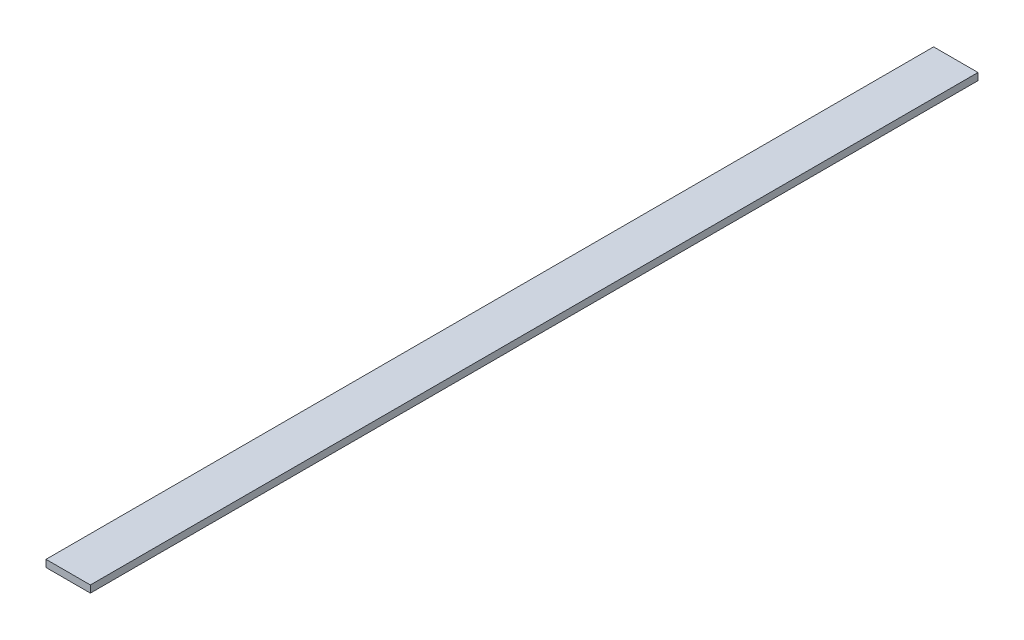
ISO-10303-21;
HEADER;
FILE_DESCRIPTION(('STEP AP214'),'2;1');
FILE_NAME('part.step','',(''),(''),'','','');
FILE_SCHEMA(('AUTOMOTIVE_DESIGN { 1 0 10303 214 1 1 1 1 }'));
ENDSEC;
DATA;
#1=APPLICATION_CONTEXT('core data for automotive mechanical design processes');
#2=APPLICATION_PROTOCOL_DEFINITION('international standard','automotive_design',2000,#1);
#3=PRODUCT_CONTEXT('',#1,'mechanical');
#4=PRODUCT('Part','Part','',(#3));
#5=PRODUCT_RELATED_PRODUCT_CATEGORY('part','',(#4));
#6=PRODUCT_DEFINITION_FORMATION('','',#4);
#7=PRODUCT_DEFINITION_CONTEXT('part definition',#1,'design');
#8=PRODUCT_DEFINITION('design','',#6,#7);
#9=PRODUCT_DEFINITION_SHAPE('','',#8);
#10=(LENGTH_UNIT() NAMED_UNIT(*) SI_UNIT(.MILLI.,.METRE.));
#11=(NAMED_UNIT(*) PLANE_ANGLE_UNIT() SI_UNIT($,.RADIAN.));
#12=(NAMED_UNIT(*) SI_UNIT($,.STERADIAN.) SOLID_ANGLE_UNIT());
#13=UNCERTAINTY_MEASURE_WITH_UNIT(LENGTH_MEASURE(1.E-05),#10,'distance_accuracy_value','');
#14=(GEOMETRIC_REPRESENTATION_CONTEXT(3) GLOBAL_UNCERTAINTY_ASSIGNED_CONTEXT((#13)) GLOBAL_UNIT_ASSIGNED_CONTEXT((#10,
#11,#12)) REPRESENTATION_CONTEXT('',''));
#15=CARTESIAN_POINT('',(0.,0.,0.));
#16=DIRECTION('',(0.,0.,1.));
#17=DIRECTION('',(1.,0.,0.));
#18=AXIS2_PLACEMENT_3D('',#15,#16,#17);
#19=CARTESIAN_POINT('',(-12.5,4.,1900.));
#20=DIRECTION('',(1.,0.,0.));
#21=DIRECTION('',(0.,0.,-1.));
#22=AXIS2_PLACEMENT_3D('',#19,#20,#21);
#23=PLANE('',#22);
#24=DIRECTION('',(0.,-1.,0.));
#25=VECTOR('',#24,1.);
#26=CARTESIAN_POINT('',(-12.5,4.,500.));
#27=LINE('',#26,#25);
#28=CARTESIAN_POINT('',(-12.5,4.,500.));
#29=VERTEX_POINT('',#28);
#30=CARTESIAN_POINT('',(-12.5,0.,500.));
#31=VERTEX_POINT('',#30);
#32=EDGE_CURVE('E54',#29,#31,#27,.T.);
#33=ORIENTED_EDGE('',*,*,#32,.F.);
#34=DIRECTION('',(0.,0.,-1.));
#35=VECTOR('',#34,1.);
#36=CARTESIAN_POINT('',(-12.5,4.,1900.));
#37=LINE('',#36,#35);
#38=CARTESIAN_POINT('',(-12.5,4.,0.));
#39=VERTEX_POINT('',#38);
#40=EDGE_CURVE('E36',#29,#39,#37,.T.);
#41=ORIENTED_EDGE('',*,*,#40,.T.);
#42=DIRECTION('',(0.,-1.,0.));
#43=VECTOR('',#42,1.);
#44=CARTESIAN_POINT('',(-12.5,4.,0.));
#45=LINE('',#44,#43);
#46=CARTESIAN_POINT('',(-12.5,0.,0.));
#47=VERTEX_POINT('',#46);
#48=EDGE_CURVE('E83',#39,#47,#45,.T.);
#49=ORIENTED_EDGE('',*,*,#48,.T.);
#50=DIRECTION('',(0.,0.,-1.));
#51=VECTOR('',#50,1.);
#52=CARTESIAN_POINT('',(-12.5,0.,1900.));
#53=LINE('',#52,#51);
#54=EDGE_CURVE('E9',#31,#47,#53,.T.);
#55=ORIENTED_EDGE('',*,*,#54,.F.);
#56=EDGE_LOOP('',(#33,#41,#49,#55));
#57=FACE_BOUND('',#56,.T.);
#58=ADVANCED_FACE('F14',(#57),#23,.F.);
#59=CARTESIAN_POINT('',(-12.5,0.,1900.));
#60=DIRECTION('',(0.,1.,0.));
#61=DIRECTION('',(-1.,0.,0.));
#62=AXIS2_PLACEMENT_3D('',#59,#60,#61);
#63=PLANE('',#62);
#64=DIRECTION('',(1.,0.,0.));
#65=VECTOR('',#64,1.);
#66=CARTESIAN_POINT('',(-12.5,0.,500.));
#67=LINE('',#66,#65);
#68=CARTESIAN_POINT('',(12.5,0.,500.));
#69=VERTEX_POINT('',#68);
#70=EDGE_CURVE('E60',#31,#69,#67,.T.);
#71=ORIENTED_EDGE('',*,*,#70,.F.);
#72=ORIENTED_EDGE('',*,*,#54,.T.);
#73=DIRECTION('',(1.,0.,0.));
#74=VECTOR('',#73,1.);
#75=CARTESIAN_POINT('',(-12.5,0.,0.));
#76=LINE('',#75,#74);
#77=CARTESIAN_POINT('',(12.5,0.,0.));
#78=VERTEX_POINT('',#77);
#79=EDGE_CURVE('E80',#47,#78,#76,.T.);
#80=ORIENTED_EDGE('',*,*,#79,.T.);
#81=DIRECTION('',(0.,0.,-1.));
#82=VECTOR('',#81,1.);
#83=CARTESIAN_POINT('',(12.5,0.,1900.));
#84=LINE('',#83,#82);
#85=EDGE_CURVE('E21',#69,#78,#84,.T.);
#86=ORIENTED_EDGE('',*,*,#85,.F.);
#87=EDGE_LOOP('',(#71,#72,#80,#86));
#88=FACE_BOUND('',#87,.T.);
#89=ADVANCED_FACE('F81',(#88),#63,.F.);
#90=CARTESIAN_POINT('',(12.5,4.,1900.));
#91=DIRECTION('',(-1.,0.,0.));
#92=DIRECTION('',(0.,0.,1.));
#93=AXIS2_PLACEMENT_3D('',#90,#91,#92);
#94=PLANE('',#93);
#95=DIRECTION('',(0.,1.,0.));
#96=VECTOR('',#95,1.);
#97=CARTESIAN_POINT('',(12.5,0.,500.));
#98=LINE('',#97,#96);
#99=CARTESIAN_POINT('',(12.5,4.,500.));
#100=VERTEX_POINT('',#99);
#101=EDGE_CURVE('E28',#69,#100,#98,.T.);
#102=ORIENTED_EDGE('',*,*,#101,.F.);
#103=ORIENTED_EDGE('',*,*,#85,.T.);
#104=DIRECTION('',(0.,1.,0.));
#105=VECTOR('',#104,1.);
#106=CARTESIAN_POINT('',(12.5,4.,0.));
#107=LINE('',#106,#105);
#108=CARTESIAN_POINT('',(12.5,4.,0.));
#109=VERTEX_POINT('',#108);
#110=EDGE_CURVE('E69',#78,#109,#107,.T.);
#111=ORIENTED_EDGE('',*,*,#110,.T.);
#112=DIRECTION('',(0.,0.,-1.));
#113=VECTOR('',#112,1.);
#114=CARTESIAN_POINT('',(12.5,4.,1900.));
#115=LINE('',#114,#113);
#116=EDGE_CURVE('E66',#100,#109,#115,.T.);
#117=ORIENTED_EDGE('',*,*,#116,.F.);
#118=EDGE_LOOP('',(#102,#103,#111,#117));
#119=FACE_BOUND('',#118,.T.);
#120=ADVANCED_FACE('F76',(#119),#94,.F.);
#121=CARTESIAN_POINT('',(-12.5,4.,1900.));
#122=DIRECTION('',(0.,-1.,0.));
#123=DIRECTION('',(0.,0.,-1.));
#124=AXIS2_PLACEMENT_3D('',#121,#122,#123);
#125=PLANE('',#124);
#126=DIRECTION('',(-1.,0.,0.));
#127=VECTOR('',#126,1.);
#128=CARTESIAN_POINT('',(12.5,4.,500.));
#129=LINE('',#128,#127);
#130=EDGE_CURVE('E52',#100,#29,#129,.T.);
#131=ORIENTED_EDGE('',*,*,#130,.F.);
#132=ORIENTED_EDGE('',*,*,#116,.T.);
#133=DIRECTION('',(-1.,0.,0.));
#134=VECTOR('',#133,1.);
#135=CARTESIAN_POINT('',(-12.5,4.,0.));
#136=LINE('',#135,#134);
#137=EDGE_CURVE('E64',#109,#39,#136,.T.);
#138=ORIENTED_EDGE('',*,*,#137,.T.);
#139=ORIENTED_EDGE('',*,*,#40,.F.);
#140=EDGE_LOOP('',(#131,#132,#138,#139));
#141=FACE_BOUND('',#140,.T.);
#142=ADVANCED_FACE('F62',(#141),#125,.F.);
#143=CARTESIAN_POINT('',(-12.5,4.,0.));
#144=DIRECTION('',(0.,0.,1.));
#145=DIRECTION('',(1.,0.,0.));
#146=AXIS2_PLACEMENT_3D('',#143,#144,#145);
#147=PLANE('',#146);
#148=ORIENTED_EDGE('',*,*,#48,.F.);
#149=ORIENTED_EDGE('',*,*,#137,.F.);
#150=ORIENTED_EDGE('',*,*,#110,.F.);
#151=ORIENTED_EDGE('',*,*,#79,.F.);
#152=EDGE_LOOP('',(#148,#149,#150,#151));
#153=FACE_BOUND('',#152,.T.);
#154=ADVANCED_FACE('F85',(#153),#147,.F.);
#155=CARTESIAN_POINT('',(-12.5,4.,500.));
#156=DIRECTION('',(0.,0.,1.));
#157=DIRECTION('',(1.,0.,0.));
#158=AXIS2_PLACEMENT_3D('',#155,#156,#157);
#159=PLANE('',#158);
#160=ORIENTED_EDGE('',*,*,#130,.T.);
#161=ORIENTED_EDGE('',*,*,#32,.T.);
#162=ORIENTED_EDGE('',*,*,#70,.T.);
#163=ORIENTED_EDGE('',*,*,#101,.T.);
#164=EDGE_LOOP('',(#160,#161,#162,#163));
#165=FACE_BOUND('',#164,.T.);
#166=ADVANCED_FACE('F53',(#165),#159,.T.);
#167=CLOSED_SHELL('',(#58,#89,#120,#142,#154,#166));
#168=MANIFOLD_SOLID_BREP('B1',#167);
#169=ADVANCED_BREP_SHAPE_REPRESENTATION('',(#18,#168),#14);
#170=SHAPE_DEFINITION_REPRESENTATION(#9,#169);
ENDSEC;
END-ISO-10303-21;
